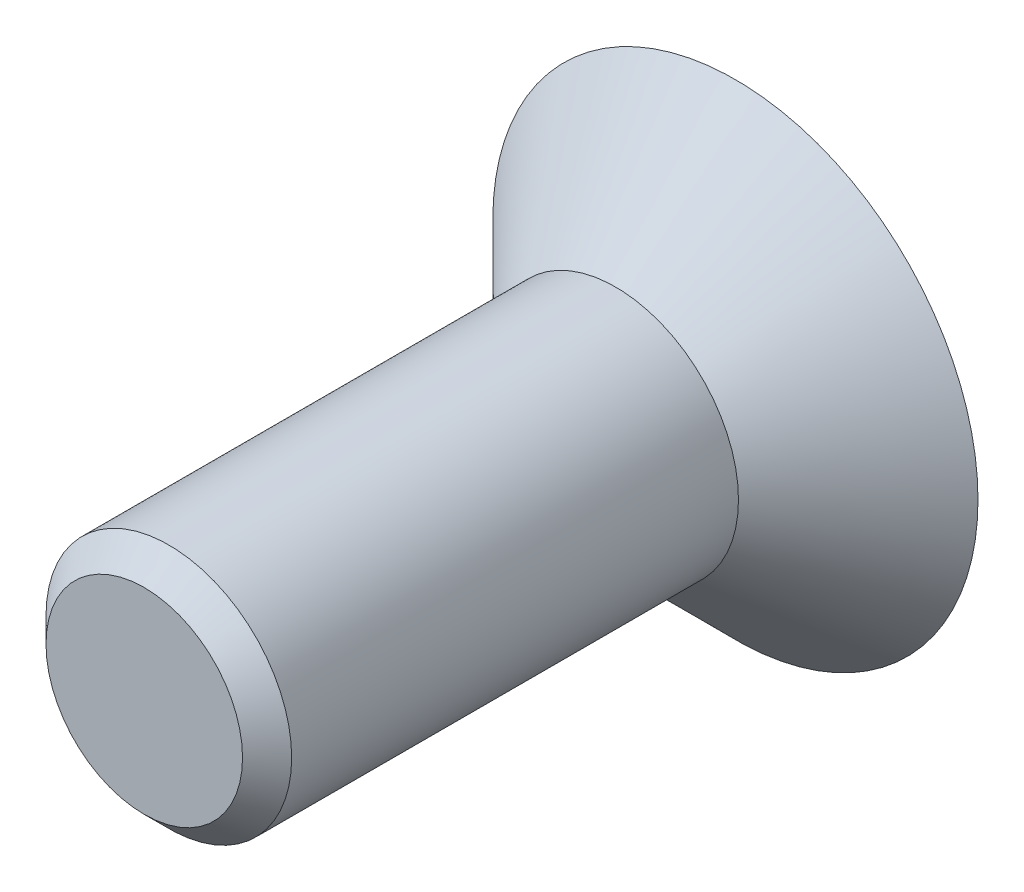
ISO-10303-21;
HEADER;
FILE_DESCRIPTION(('STEP AP214'),'2;1');
FILE_NAME('part.step','',(''),(''),'','','');
FILE_SCHEMA(('AUTOMOTIVE_DESIGN { 1 0 10303 214 1 1 1 1 }'));
ENDSEC;
DATA;
#1=APPLICATION_CONTEXT('core data for automotive mechanical design processes');
#2=APPLICATION_PROTOCOL_DEFINITION('international standard','automotive_design',2000,#1);
#3=PRODUCT_CONTEXT('',#1,'mechanical');
#4=PRODUCT('Part','Part','',(#3));
#5=PRODUCT_RELATED_PRODUCT_CATEGORY('part','',(#4));
#6=PRODUCT_DEFINITION_FORMATION('','',#4);
#7=PRODUCT_DEFINITION_CONTEXT('part definition',#1,'design');
#8=PRODUCT_DEFINITION('design','',#6,#7);
#9=PRODUCT_DEFINITION_SHAPE('','',#8);
#10=(LENGTH_UNIT() NAMED_UNIT(*) SI_UNIT(.MILLI.,.METRE.));
#11=(NAMED_UNIT(*) PLANE_ANGLE_UNIT() SI_UNIT($,.RADIAN.));
#12=(NAMED_UNIT(*) SI_UNIT($,.STERADIAN.) SOLID_ANGLE_UNIT());
#13=UNCERTAINTY_MEASURE_WITH_UNIT(LENGTH_MEASURE(1.E-05),#10,'distance_accuracy_value','');
#14=(GEOMETRIC_REPRESENTATION_CONTEXT(3) GLOBAL_UNCERTAINTY_ASSIGNED_CONTEXT((#13)) GLOBAL_UNIT_ASSIGNED_CONTEXT((#10,
#11,#12)) REPRESENTATION_CONTEXT('',''));
#15=CARTESIAN_POINT('',(0.,0.,0.));
#16=DIRECTION('',(0.,0.,1.));
#17=DIRECTION('',(1.,0.,0.));
#18=AXIS2_PLACEMENT_3D('',#15,#16,#17);
#19=CARTESIAN_POINT('',(0.,0.,-3.89999999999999));
#20=DIRECTION('',(0.,0.,1.));
#21=DIRECTION('',(1.,0.,0.));
#22=AXIS2_PLACEMENT_3D('',#19,#20,#21);
#23=PLANE('',#22);
#24=CARTESIAN_POINT('',(0.,0.,-3.89999999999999));
#25=DIRECTION('',(0.,0.,-1.));
#26=DIRECTION('',(-1.,0.,0.));
#27=AXIS2_PLACEMENT_3D('',#24,#25,#26);
#28=CIRCLE('',#27,7.9);
#29=CARTESIAN_POINT('',(-7.9,0.,-3.89999999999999));
#30=VERTEX_POINT('',#29);
#31=EDGE_CURVE('E97',#30,#30,#28,.T.);
#32=ORIENTED_EDGE('',*,*,#31,.T.);
#33=EDGE_LOOP('',(#32));
#34=FACE_BOUND('',#33,.T.);
#35=DIRECTION('',(-0.86602540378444,0.499999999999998,0.));
#36=VECTOR('',#35,1.);
#37=CARTESIAN_POINT('',(0.,2.88675134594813,-3.89999999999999));
#38=LINE('',#37,#36);
#39=CARTESIAN_POINT('',(2.5,1.44337567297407,-3.89999999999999));
#40=VERTEX_POINT('',#39);
#41=CARTESIAN_POINT('',(0.,2.88675134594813,-3.89999999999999));
#42=VERTEX_POINT('',#41);
#43=EDGE_CURVE('E43',#40,#42,#38,.T.);
#44=ORIENTED_EDGE('',*,*,#43,.T.);
#45=DIRECTION('',(-0.866025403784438,-0.500000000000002,0.));
#46=VECTOR('',#45,1.);
#47=CARTESIAN_POINT('',(-2.5,1.44337567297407,-3.89999999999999));
#48=LINE('',#47,#46);
#49=CARTESIAN_POINT('',(-2.5,1.44337567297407,-3.89999999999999));
#50=VERTEX_POINT('',#49);
#51=EDGE_CURVE('E83',#42,#50,#48,.T.);
#52=ORIENTED_EDGE('',*,*,#51,.T.);
#53=DIRECTION('',(0.,-1.,0.));
#54=VECTOR('',#53,1.);
#55=CARTESIAN_POINT('',(-2.5,-1.44337567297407,-3.89999999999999));
#56=LINE('',#55,#54);
#57=CARTESIAN_POINT('',(-2.5,-1.44337567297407,-3.89999999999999));
#58=VERTEX_POINT('',#57);
#59=EDGE_CURVE('E91',#50,#58,#56,.T.);
#60=ORIENTED_EDGE('',*,*,#59,.T.);
#61=DIRECTION('',(0.866025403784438,-0.500000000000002,0.));
#62=VECTOR('',#61,1.);
#63=CARTESIAN_POINT('',(-2.5,-1.44337567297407,-3.89999999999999));
#64=LINE('',#63,#62);
#65=CARTESIAN_POINT('',(0.,-2.88675134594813,-3.89999999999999));
#66=VERTEX_POINT('',#65);
#67=EDGE_CURVE('E109',#58,#66,#64,.T.);
#68=ORIENTED_EDGE('',*,*,#67,.T.);
#69=DIRECTION('',(0.86602540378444,0.499999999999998,0.));
#70=VECTOR('',#69,1.);
#71=CARTESIAN_POINT('',(0.,-2.88675134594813,-3.89999999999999));
#72=LINE('',#71,#70);
#73=CARTESIAN_POINT('',(2.5,-1.44337567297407,-3.89999999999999));
#74=VERTEX_POINT('',#73);
#75=EDGE_CURVE('E112',#66,#74,#72,.T.);
#76=ORIENTED_EDGE('',*,*,#75,.T.);
#77=DIRECTION('',(0.,1.,0.));
#78=VECTOR('',#77,1.);
#79=CARTESIAN_POINT('',(2.5,-1.44337567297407,-3.89999999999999));
#80=LINE('',#79,#78);
#81=EDGE_CURVE('E102',#74,#40,#80,.T.);
#82=ORIENTED_EDGE('',*,*,#81,.T.);
#83=EDGE_LOOP('',(#44,#52,#60,#68,#76,#82));
#84=FACE_BOUND('',#83,.T.);
#85=ADVANCED_FACE('F29',(#34,#84),#23,.F.);
#86=CARTESIAN_POINT('',(0.,0.,0.));
#87=DIRECTION('',(0.,0.,-1.));
#88=DIRECTION('',(-1.,0.,0.));
#89=AXIS2_PLACEMENT_3D('',#86,#87,#88);
#90=CONICAL_SURFACE('',#89,4.,0.78539816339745);
#91=ORIENTED_EDGE('',*,*,#31,.F.);
#92=EDGE_LOOP('',(#91));
#93=FACE_BOUND('',#92,.T.);
#94=CARTESIAN_POINT('',(0.,0.,0.));
#95=DIRECTION('',(0.,0.,1.));
#96=DIRECTION('',(1.,0.,0.));
#97=AXIS2_PLACEMENT_3D('',#94,#95,#96);
#98=CIRCLE('',#97,4.);
#99=CARTESIAN_POINT('',(4.,0.,0.));
#100=VERTEX_POINT('',#99);
#101=EDGE_CURVE('E103',#100,#100,#98,.T.);
#102=ORIENTED_EDGE('',*,*,#101,.F.);
#103=EDGE_LOOP('',(#102));
#104=FACE_BOUND('',#103,.T.);
#105=ADVANCED_FACE('F152',(#93,#104),#90,.T.);
#106=CARTESIAN_POINT('',(0.,2.88675134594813,-0.0999999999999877));
#107=DIRECTION('',(-0.499999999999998,-0.86602540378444,0.));
#108=DIRECTION('',(0.86602540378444,-0.499999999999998,0.));
#109=AXIS2_PLACEMENT_3D('',#106,#107,#108);
#110=PLANE('',#109);
#111=ORIENTED_EDGE('',*,*,#43,.F.);
#112=DIRECTION('',(0.,0.,-1.));
#113=VECTOR('',#112,1.);
#114=CARTESIAN_POINT('',(2.5,1.44337567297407,-0.0999999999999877));
#115=LINE('',#114,#113);
#116=CARTESIAN_POINT('',(2.5,1.44337567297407,-0.0999999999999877));
#117=VERTEX_POINT('',#116);
#118=EDGE_CURVE('E125',#117,#40,#115,.T.);
#119=ORIENTED_EDGE('',*,*,#118,.F.);
#120=DIRECTION('',(-0.86602540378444,0.499999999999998,0.));
#121=VECTOR('',#120,1.);
#122=CARTESIAN_POINT('',(0.,2.88675134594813,-0.0999999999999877));
#123=LINE('',#122,#121);
#124=CARTESIAN_POINT('',(0.,2.88675134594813,-0.0999999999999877));
#125=VERTEX_POINT('',#124);
#126=EDGE_CURVE('E96',#117,#125,#123,.T.);
#127=ORIENTED_EDGE('',*,*,#126,.T.);
#128=DIRECTION('',(0.,0.,-1.));
#129=VECTOR('',#128,1.);
#130=CARTESIAN_POINT('',(0.,2.88675134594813,-0.0999999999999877));
#131=LINE('',#130,#129);
#132=EDGE_CURVE('E85',#125,#42,#131,.T.);
#133=ORIENTED_EDGE('',*,*,#132,.T.);
#134=EDGE_LOOP('',(#111,#119,#127,#133));
#135=FACE_BOUND('',#134,.T.);
#136=ADVANCED_FACE('F94',(#135),#110,.T.);
#137=CARTESIAN_POINT('',(-2.5,1.44337567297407,-0.0999999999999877));
#138=DIRECTION('',(0.500000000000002,-0.866025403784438,0.));
#139=DIRECTION('',(0.866025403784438,0.500000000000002,0.));
#140=AXIS2_PLACEMENT_3D('',#137,#138,#139);
#141=PLANE('',#140);
#142=ORIENTED_EDGE('',*,*,#51,.F.);
#143=ORIENTED_EDGE('',*,*,#132,.F.);
#144=DIRECTION('',(-0.866025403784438,-0.500000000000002,0.));
#145=VECTOR('',#144,1.);
#146=CARTESIAN_POINT('',(-2.5,1.44337567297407,-0.0999999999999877));
#147=LINE('',#146,#145);
#148=CARTESIAN_POINT('',(-2.5,1.44337567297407,-0.0999999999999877));
#149=VERTEX_POINT('',#148);
#150=EDGE_CURVE('E116',#125,#149,#147,.T.);
#151=ORIENTED_EDGE('',*,*,#150,.T.);
#152=DIRECTION('',(0.,0.,-1.));
#153=VECTOR('',#152,1.);
#154=CARTESIAN_POINT('',(-2.5,1.44337567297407,-0.0999999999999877));
#155=LINE('',#154,#153);
#156=EDGE_CURVE('E87',#149,#50,#155,.T.);
#157=ORIENTED_EDGE('',*,*,#156,.T.);
#158=EDGE_LOOP('',(#142,#143,#151,#157));
#159=FACE_BOUND('',#158,.T.);
#160=ADVANCED_FACE('F84',(#159),#141,.T.);
#161=CARTESIAN_POINT('',(-2.5,-1.44337567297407,-0.0999999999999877));
#162=DIRECTION('',(1.,0.,0.));
#163=DIRECTION('',(0.,0.,-1.));
#164=AXIS2_PLACEMENT_3D('',#161,#162,#163);
#165=PLANE('',#164);
#166=ORIENTED_EDGE('',*,*,#59,.F.);
#167=ORIENTED_EDGE('',*,*,#156,.F.);
#168=DIRECTION('',(0.,-1.,0.));
#169=VECTOR('',#168,1.);
#170=CARTESIAN_POINT('',(-2.5,-1.44337567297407,-0.0999999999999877));
#171=LINE('',#170,#169);
#172=CARTESIAN_POINT('',(-2.5,-1.44337567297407,-0.0999999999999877));
#173=VERTEX_POINT('',#172);
#174=EDGE_CURVE('E118',#149,#173,#171,.T.);
#175=ORIENTED_EDGE('',*,*,#174,.T.);
#176=DIRECTION('',(0.,0.,-1.));
#177=VECTOR('',#176,1.);
#178=CARTESIAN_POINT('',(-2.5,-1.44337567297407,-0.0999999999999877));
#179=LINE('',#178,#177);
#180=EDGE_CURVE('E131',#173,#58,#179,.T.);
#181=ORIENTED_EDGE('',*,*,#180,.T.);
#182=EDGE_LOOP('',(#166,#167,#175,#181));
#183=FACE_BOUND('',#182,.T.);
#184=ADVANCED_FACE('F169',(#183),#165,.T.);
#185=CARTESIAN_POINT('',(-2.5,-1.44337567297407,-0.0999999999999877));
#186=DIRECTION('',(0.500000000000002,0.866025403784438,0.));
#187=DIRECTION('',(-0.866025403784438,0.500000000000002,0.));
#188=AXIS2_PLACEMENT_3D('',#185,#186,#187);
#189=PLANE('',#188);
#190=ORIENTED_EDGE('',*,*,#67,.F.);
#191=ORIENTED_EDGE('',*,*,#180,.F.);
#192=DIRECTION('',(0.866025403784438,-0.500000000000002,0.));
#193=VECTOR('',#192,1.);
#194=CARTESIAN_POINT('',(-2.5,-1.44337567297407,-0.0999999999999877));
#195=LINE('',#194,#193);
#196=CARTESIAN_POINT('',(0.,-2.88675134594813,-0.0999999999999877));
#197=VERTEX_POINT('',#196);
#198=EDGE_CURVE('E120',#173,#197,#195,.T.);
#199=ORIENTED_EDGE('',*,*,#198,.T.);
#200=DIRECTION('',(0.,0.,-1.));
#201=VECTOR('',#200,1.);
#202=CARTESIAN_POINT('',(0.,-2.88675134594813,-0.0999999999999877));
#203=LINE('',#202,#201);
#204=EDGE_CURVE('E129',#197,#66,#203,.T.);
#205=ORIENTED_EDGE('',*,*,#204,.T.);
#206=EDGE_LOOP('',(#190,#191,#199,#205));
#207=FACE_BOUND('',#206,.T.);
#208=ADVANCED_FACE('F172',(#207),#189,.T.);
#209=CARTESIAN_POINT('',(0.,-2.88675134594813,-0.0999999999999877));
#210=DIRECTION('',(-0.499999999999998,0.86602540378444,0.));
#211=DIRECTION('',(-0.86602540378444,-0.499999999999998,0.));
#212=AXIS2_PLACEMENT_3D('',#209,#210,#211);
#213=PLANE('',#212);
#214=ORIENTED_EDGE('',*,*,#75,.F.);
#215=ORIENTED_EDGE('',*,*,#204,.F.);
#216=DIRECTION('',(0.86602540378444,0.499999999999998,0.));
#217=VECTOR('',#216,1.);
#218=CARTESIAN_POINT('',(0.,-2.88675134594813,-0.0999999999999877));
#219=LINE('',#218,#217);
#220=CARTESIAN_POINT('',(2.5,-1.44337567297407,-0.0999999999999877));
#221=VERTEX_POINT('',#220);
#222=EDGE_CURVE('E122',#197,#221,#219,.T.);
#223=ORIENTED_EDGE('',*,*,#222,.T.);
#224=DIRECTION('',(0.,0.,-1.));
#225=VECTOR('',#224,1.);
#226=CARTESIAN_POINT('',(2.5,-1.44337567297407,-0.0999999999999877));
#227=LINE('',#226,#225);
#228=EDGE_CURVE('E127',#221,#74,#227,.T.);
#229=ORIENTED_EDGE('',*,*,#228,.T.);
#230=EDGE_LOOP('',(#214,#215,#223,#229));
#231=FACE_BOUND('',#230,.T.);
#232=ADVANCED_FACE('F176',(#231),#213,.T.);
#233=CARTESIAN_POINT('',(2.5,-1.44337567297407,-0.0999999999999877));
#234=DIRECTION('',(-1.,0.,0.));
#235=DIRECTION('',(0.,0.,1.));
#236=AXIS2_PLACEMENT_3D('',#233,#234,#235);
#237=PLANE('',#236);
#238=ORIENTED_EDGE('',*,*,#81,.F.);
#239=ORIENTED_EDGE('',*,*,#228,.F.);
#240=DIRECTION('',(0.,1.,0.));
#241=VECTOR('',#240,1.);
#242=CARTESIAN_POINT('',(2.5,-1.44337567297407,-0.0999999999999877));
#243=LINE('',#242,#241);
#244=EDGE_CURVE('E50',#221,#117,#243,.T.);
#245=ORIENTED_EDGE('',*,*,#244,.T.);
#246=ORIENTED_EDGE('',*,*,#118,.T.);
#247=EDGE_LOOP('',(#238,#239,#245,#246));
#248=FACE_BOUND('',#247,.T.);
#249=ADVANCED_FACE('F180',(#248),#237,.T.);
#250=CARTESIAN_POINT('',(2.5,1.44337567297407,-0.0999999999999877));
#251=DIRECTION('',(0.,0.,1.));
#252=DIRECTION('',(1.,0.,0.));
#253=AXIS2_PLACEMENT_3D('',#250,#251,#252);
#254=PLANE('',#253);
#255=ORIENTED_EDGE('',*,*,#126,.F.);
#256=ORIENTED_EDGE('',*,*,#244,.F.);
#257=ORIENTED_EDGE('',*,*,#222,.F.);
#258=ORIENTED_EDGE('',*,*,#198,.F.);
#259=ORIENTED_EDGE('',*,*,#174,.F.);
#260=ORIENTED_EDGE('',*,*,#150,.F.);
#261=EDGE_LOOP('',(#255,#256,#257,#258,#259,#260));
#262=FACE_BOUND('',#261,.T.);
#263=ADVANCED_FACE('F184',(#262),#254,.F.);
#264=CARTESIAN_POINT('',(0.,0.,15.35));
#265=DIRECTION('',(0.,0.,1.));
#266=DIRECTION('',(1.,0.,0.));
#267=AXIS2_PLACEMENT_3D('',#264,#265,#266);
#268=PLANE('',#267);
#269=CARTESIAN_POINT('',(0.,0.,15.35));
#270=DIRECTION('',(0.,0.,1.));
#271=DIRECTION('',(1.,0.,0.));
#272=AXIS2_PLACEMENT_3D('',#269,#270,#271);
#273=CIRCLE('',#272,3.2);
#274=CARTESIAN_POINT('',(3.2,0.,15.35));
#275=VERTEX_POINT('',#274);
#276=EDGE_CURVE('E36',#275,#275,#273,.T.);
#277=ORIENTED_EDGE('',*,*,#276,.T.);
#278=EDGE_LOOP('',(#277));
#279=FACE_BOUND('',#278,.T.);
#280=ADVANCED_FACE('F138',(#279),#268,.T.);
#281=CARTESIAN_POINT('',(0.,0.,0.));
#282=DIRECTION('',(0.,0.,1.));
#283=DIRECTION('',(1.,0.,0.));
#284=AXIS2_PLACEMENT_3D('',#281,#282,#283);
#285=CYLINDRICAL_SURFACE('',#284,4.);
#286=CARTESIAN_POINT('',(0.,0.,14.55));
#287=DIRECTION('',(0.,0.,1.));
#288=DIRECTION('',(1.,0.,0.));
#289=AXIS2_PLACEMENT_3D('',#286,#287,#288);
#290=CIRCLE('',#289,4.);
#291=CARTESIAN_POINT('',(4.,0.,14.55));
#292=VERTEX_POINT('',#291);
#293=EDGE_CURVE('E11',#292,#292,#290,.F.);
#294=ORIENTED_EDGE('',*,*,#293,.T.);
#295=EDGE_LOOP('',(#294));
#296=FACE_BOUND('',#295,.T.);
#297=ORIENTED_EDGE('',*,*,#101,.T.);
#298=EDGE_LOOP('',(#297));
#299=FACE_BOUND('',#298,.T.);
#300=ADVANCED_FACE('F142',(#296,#299),#285,.T.);
#301=CARTESIAN_POINT('',(0.,0.,15.35));
#302=DIRECTION('',(0.,0.,-1.));
#303=DIRECTION('',(-1.,0.,0.));
#304=AXIS2_PLACEMENT_3D('',#301,#302,#303);
#305=CONICAL_SURFACE('',#304,3.2,0.785398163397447);
#306=ORIENTED_EDGE('',*,*,#293,.F.);
#307=EDGE_LOOP('',(#306));
#308=FACE_BOUND('',#307,.T.);
#309=ORIENTED_EDGE('',*,*,#276,.F.);
#310=EDGE_LOOP('',(#309));
#311=FACE_BOUND('',#310,.T.);
#312=ADVANCED_FACE('F140',(#308,#311),#305,.T.);
#313=CLOSED_SHELL('',(#85,#105,#136,#160,#184,#208,#232,#249,#263,#280,#300,#312));
#314=MANIFOLD_SOLID_BREP('B2',#313);
#315=ADVANCED_BREP_SHAPE_REPRESENTATION('',(#18,#314),#14);
#316=SHAPE_DEFINITION_REPRESENTATION(#9,#315);
ENDSEC;
END-ISO-10303-21;
